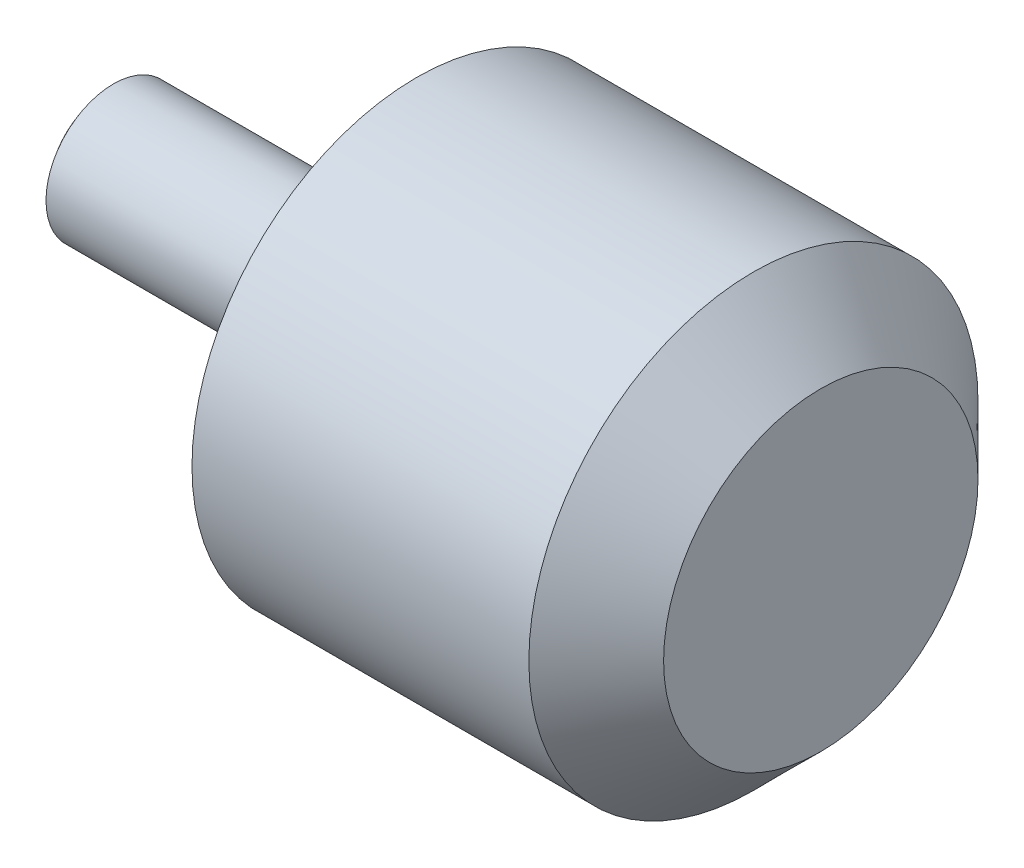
from build123d import *


with BuildPart() as part:
    # Sketch1 → Revolve1 (revolve)
    with BuildSketch(Plane(origin=(0, 0, 0), x_dir=(1, 0, 0), z_dir=(0, 1, 0)), mode=Mode.PRIVATE) as revolve1_sk:
        with BuildLine():
            Line((0, 0), (32.572934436, 0))
            Line((32.572934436, 0), (32.572934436, 7))
            Line((32.572934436, 7), (29.572934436, 10))
            Line((29.572934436, 10), (14.572934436, 10))
            Line((14.572934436, 10), (14.572934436, 5))
            Line((14.572934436, 5), (11.072934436, 5))
            Line((11.072934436, 5), (11.072934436, 3))
            Line((11.072934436, 3), (1.072934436, 3))
            ThreePointArc((1.072934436, 3), (0.276302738, 1.593046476), (0, 0))
        make_face()
    revolve(revolve1_sk.sketch.rotate(Axis((0, 0, 0), (1, 0, 0)), 180), axis=Axis((0, 0, 0), (1, 0, 0)))


solid = part.part
